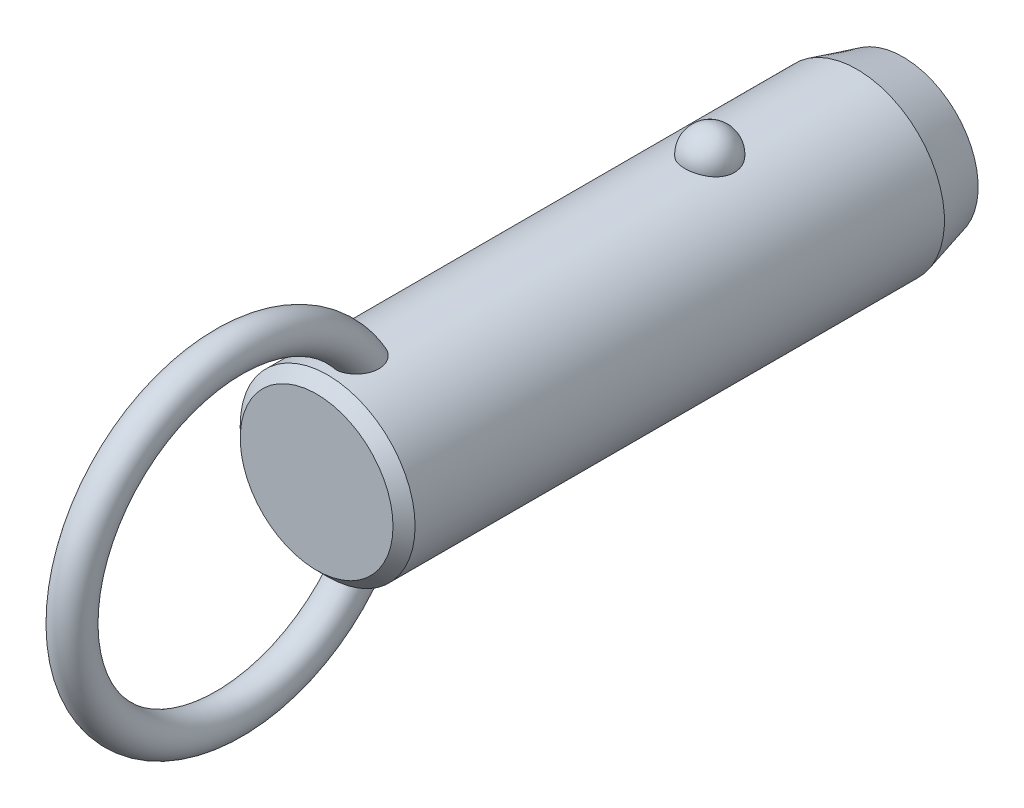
ISO-10303-21;
HEADER;
FILE_DESCRIPTION(('STEP AP214'),'2;1');
FILE_NAME('part.step','',(''),(''),'','','');
FILE_SCHEMA(('AUTOMOTIVE_DESIGN { 1 0 10303 214 1 1 1 1 }'));
ENDSEC;
DATA;
#1=APPLICATION_CONTEXT('core data for automotive mechanical design processes');
#2=APPLICATION_PROTOCOL_DEFINITION('international standard','automotive_design',2000,#1);
#3=PRODUCT_CONTEXT('',#1,'mechanical');
#4=PRODUCT('Part','Part','',(#3));
#5=PRODUCT_RELATED_PRODUCT_CATEGORY('part','',(#4));
#6=PRODUCT_DEFINITION_FORMATION('','',#4);
#7=PRODUCT_DEFINITION_CONTEXT('part definition',#1,'design');
#8=PRODUCT_DEFINITION('design','',#6,#7);
#9=PRODUCT_DEFINITION_SHAPE('','',#8);
#10=(LENGTH_UNIT() NAMED_UNIT(*) SI_UNIT(.MILLI.,.METRE.));
#11=(NAMED_UNIT(*) PLANE_ANGLE_UNIT() SI_UNIT($,.RADIAN.));
#12=(NAMED_UNIT(*) SI_UNIT($,.STERADIAN.) SOLID_ANGLE_UNIT());
#13=UNCERTAINTY_MEASURE_WITH_UNIT(LENGTH_MEASURE(1.E-05),#10,'distance_accuracy_value','');
#14=(GEOMETRIC_REPRESENTATION_CONTEXT(3) GLOBAL_UNCERTAINTY_ASSIGNED_CONTEXT((#13)) GLOBAL_UNIT_ASSIGNED_CONTEXT((#10,
#11,#12)) REPRESENTATION_CONTEXT('',''));
#15=CARTESIAN_POINT('',(0.,0.,0.));
#16=DIRECTION('',(0.,0.,1.));
#17=DIRECTION('',(1.,0.,0.));
#18=AXIS2_PLACEMENT_3D('',#15,#16,#17);
#19=CARTESIAN_POINT('',(0.,0.,30.5));
#20=DIRECTION('',(0.,0.,-1.));
#21=DIRECTION('',(-1.,0.,0.));
#22=AXIS2_PLACEMENT_3D('',#19,#20,#21);
#23=CYLINDRICAL_SURFACE('',#22,9.5);
#24=CARTESIAN_POINT('',(2.67259918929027,9.11631578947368,-2.70000000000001));
#25=CARTESIAN_POINT('',(2.6725968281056,9.11631786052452,-2.54909854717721));
#26=CARTESIAN_POINT('',(2.66030567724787,9.11994722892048,-2.39816735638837));
#27=CARTESIAN_POINT('',(2.6114347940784,9.13405924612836,-2.10058568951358));
#28=CARTESIAN_POINT('',(2.57484658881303,9.14454428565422,-1.95393672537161));
#29=CARTESIAN_POINT('',(2.47830875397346,9.17117631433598,-1.66916069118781));
#30=CARTESIAN_POINT('',(2.41836936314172,9.18732082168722,-1.53102991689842));
#31=CARTESIAN_POINT('',(2.27661331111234,9.22346780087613,-1.26705393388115));
#32=CARTESIAN_POINT('',(2.19479699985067,9.24347021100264,-1.14120852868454));
#33=CARTESIAN_POINT('',(2.01085282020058,9.28522401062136,-0.90463270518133));
#34=CARTESIAN_POINT('',(1.90862396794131,9.30698376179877,-0.793982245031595));
#35=CARTESIAN_POINT('',(1.6867437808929,9.34973971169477,-0.591607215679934));
#36=CARTESIAN_POINT('',(1.56709244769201,9.37073591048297,-0.499882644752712));
#37=CARTESIAN_POINT('',(1.31393976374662,9.40956370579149,-0.338167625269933));
#38=CARTESIAN_POINT('',(1.18048026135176,9.42740444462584,-0.268113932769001));
#39=CARTESIAN_POINT('',(0.903154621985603,9.45799906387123,-0.151390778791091));
#40=CARTESIAN_POINT('',(0.759289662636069,9.47075351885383,-0.104718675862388));
#41=CARTESIAN_POINT('',(0.468074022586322,9.48956256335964,-0.0367633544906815));
#42=CARTESIAN_POINT('',(0.320836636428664,9.49573643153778,-0.0150275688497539));
#43=CARTESIAN_POINT('',(0.0246714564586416,9.50112183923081,0.00396199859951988));
#44=CARTESIAN_POINT('',(-0.124256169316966,9.50033406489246,0.00121819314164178));
#45=CARTESIAN_POINT('',(-0.417264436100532,9.4919475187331,-0.0284441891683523));
#46=CARTESIAN_POINT('',(-0.561384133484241,9.48444885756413,-0.0550074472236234));
#47=CARTESIAN_POINT('',(-0.842986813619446,9.46357853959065,-0.131064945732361));
#48=CARTESIAN_POINT('',(-0.980469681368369,9.450206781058,-0.180559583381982));
#49=CARTESIAN_POINT('',(-1.24585005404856,9.41890822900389,-0.301476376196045));
#50=CARTESIAN_POINT('',(-1.37368611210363,9.40095498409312,-0.37302638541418));
#51=CARTESIAN_POINT('',(-1.61552738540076,9.3624296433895,-0.536025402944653));
#52=CARTESIAN_POINT('',(-1.72953116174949,9.34185727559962,-0.627476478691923));
#53=CARTESIAN_POINT('',(-1.9429225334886,9.29984568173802,-0.82984483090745));
#54=CARTESIAN_POINT('',(-2.04198021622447,9.27839736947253,-0.941108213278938));
#55=CARTESIAN_POINT('',(-2.22026460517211,9.23735994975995,-1.17883414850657));
#56=CARTESIAN_POINT('',(-2.29948985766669,9.21777097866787,-1.30529781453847));
#57=CARTESIAN_POINT('',(-2.43697287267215,9.18238994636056,-1.57158566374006));
#58=CARTESIAN_POINT('',(-2.49497068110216,9.16664569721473,-1.71155057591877));
#59=CARTESIAN_POINT('',(-2.5872073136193,9.14104303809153,-1.99961197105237));
#60=CARTESIAN_POINT('',(-2.62144683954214,9.13118445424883,-2.14770821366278));
#61=CARTESIAN_POINT('',(-2.66521466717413,9.11850622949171,-2.44715424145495));
#62=CARTESIAN_POINT('',(-2.67484831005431,9.11565658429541,-2.59848735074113));
#63=CARTESIAN_POINT('',(-2.66946735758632,9.11723375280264,-2.90067317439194));
#64=CARTESIAN_POINT('',(-2.65445345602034,9.12166036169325,-3.05152590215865));
#65=CARTESIAN_POINT('',(-2.60029711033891,9.13724422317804,-3.34766110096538));
#66=CARTESIAN_POINT('',(-2.56127978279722,9.14836656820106,-3.49296833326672));
#67=CARTESIAN_POINT('',(-2.46018844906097,9.17606676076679,-3.77477535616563));
#68=CARTESIAN_POINT('',(-2.39811349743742,9.1926448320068,-3.9112747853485));
#69=CARTESIAN_POINT('',(-2.25202303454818,9.22952198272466,-4.17244273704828));
#70=CARTESIAN_POINT('',(-2.16788714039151,9.24984129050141,-4.29704106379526));
#71=CARTESIAN_POINT('',(-1.9799408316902,9.29188255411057,-4.53013066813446));
#72=CARTESIAN_POINT('',(-1.87612963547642,9.31360456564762,-4.63862130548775));
#73=CARTESIAN_POINT('',(-1.65105429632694,9.35612959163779,-4.8369029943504));
#74=CARTESIAN_POINT('',(-1.52972405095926,9.37692871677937,-4.92661991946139));
#75=CARTESIAN_POINT('',(-1.27318250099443,9.41518970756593,-5.08429106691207));
#76=CARTESIAN_POINT('',(-1.13797219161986,9.432651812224,-5.15224684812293));
#77=CARTESIAN_POINT('',(-0.859280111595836,9.46208255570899,-5.26371827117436));
#78=CARTESIAN_POINT('',(-0.715925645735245,9.47411833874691,-5.30753421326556));
#79=CARTESIAN_POINT('',(-0.423550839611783,9.4916822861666,-5.37076321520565));
#80=CARTESIAN_POINT('',(-0.274531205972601,9.49721125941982,-5.39017930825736));
#81=CARTESIAN_POINT('',(0.0218446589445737,9.50110860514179,-5.40390587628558));
#82=CARTESIAN_POINT('',(0.169177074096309,9.49961381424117,-5.39869609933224));
#83=CARTESIAN_POINT('',(0.460808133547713,9.48993906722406,-5.36441955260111));
#84=CARTESIAN_POINT('',(0.605106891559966,9.48175936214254,-5.33535367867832));
#85=CARTESIAN_POINT('',(0.886027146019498,9.4596376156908,-5.25435587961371));
#86=CARTESIAN_POINT('',(1.02267710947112,9.44571881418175,-5.20251612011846));
#87=CARTESIAN_POINT('',(1.28523827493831,9.41358993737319,-5.07741549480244));
#88=CARTESIAN_POINT('',(1.41114877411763,9.39537958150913,-5.00415322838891));
#89=CARTESIAN_POINT('',(1.65085227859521,9.3562644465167,-4.83684599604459));
#90=CARTESIAN_POINT('',(1.76442346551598,9.33532178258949,-4.74249218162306));
#91=CARTESIAN_POINT('',(1.97425672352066,9.29321198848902,-4.53620389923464));
#92=CARTESIAN_POINT('',(2.07051582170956,9.27204482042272,-4.42426641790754));
#93=CARTESIAN_POINT('',(2.24490086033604,9.23139221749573,-4.18363183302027));
#94=CARTESIAN_POINT('',(2.32267019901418,9.21194380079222,-4.05466990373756));
#95=CARTESIAN_POINT('',(2.45584092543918,9.1773419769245,-3.78517836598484));
#96=CARTESIAN_POINT('',(2.5112497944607,9.16218713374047,-3.64465264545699));
#97=CARTESIAN_POINT('',(2.59380876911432,9.13913522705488,-3.37104301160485));
#98=CARTESIAN_POINT('',(2.62330266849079,9.13064624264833,-3.23871053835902));
#99=CARTESIAN_POINT('',(2.66269870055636,9.11923566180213,-2.97092664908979));
#100=CARTESIAN_POINT('',(2.67260130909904,9.11631393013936,-2.83547530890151));
#101=CARTESIAN_POINT('',(2.67259918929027,9.11631578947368,-2.70000000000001));
#102=B_SPLINE_CURVE_WITH_KNOTS('',3,(#24,#25,#26,#27,#28,#29,#30,#31,#32,#33,#34,#35,#36,#37,
#38,#39,#40,#41,#42,#43,#44,#45,#46,#47,#48,#49,#50,#51,#52,#53,#54,#55,#56,#57,#58,#59,#60,#61,
#62,#63,#64,#65,#66,#67,#68,#69,#70,#71,#72,#73,#74,#75,#76,#77,#78,#79,#80,#81,#82,#83,#84,#85,
#86,#87,#88,#89,#90,#91,#92,#93,#94,#95,#96,#97,#98,#99,#100,#101),.UNSPECIFIED.,.T.,.F.,(4,2,2,
2,2,2,2,2,2,2,2,2,2,2,2,2,2,2,2,2,2,2,2,2,2,2,2,2,2,2,2,2,2,2,2,2,2,2,4),(0.,0.452217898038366,
0.904593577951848,1.35677112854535,1.80894144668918,2.26340676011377,2.71787203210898,
3.17099820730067,3.62407318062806,4.0687883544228,4.51345969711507,4.95160616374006,
5.38976021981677,5.83050358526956,6.27129275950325,6.72071308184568,7.17016633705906,
7.6249527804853,8.07972578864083,8.53254856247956,8.98535859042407,9.43582813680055,
9.88631615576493,10.3393155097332,10.7923328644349,11.2471065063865,11.7018475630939,
12.150795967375,12.599688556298,13.0398725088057,13.4800399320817,13.9184421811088,
14.3568730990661,14.802202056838,15.2476074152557,15.7010097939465,16.1542603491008,
16.5602594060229,16.966248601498),.UNSPECIFIED.);
#103=CARTESIAN_POINT('',(2.67259918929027,9.11631578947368,-2.70000000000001));
#104=VERTEX_POINT('',#103);
#105=EDGE_CURVE('E41',#104,#104,#102,.T.);
#106=ORIENTED_EDGE('',*,*,#105,.T.);
#107=EDGE_LOOP('',(#106));
#108=FACE_BOUND('',#107,.T.);
#109=CARTESIAN_POINT('',(0.,0.,38.82));
#110=DIRECTION('',(0.,0.,1.));
#111=DIRECTION('',(1.,0.,0.));
#112=AXIS2_PLACEMENT_3D('',#109,#110,#111);
#113=CIRCLE('',#112,9.5);
#114=CARTESIAN_POINT('',(9.5,0.,38.82));
#115=VERTEX_POINT('',#114);
#116=EDGE_CURVE('E10',#115,#115,#113,.F.);
#117=ORIENTED_EDGE('',*,*,#116,.T.);
#118=EDGE_LOOP('',(#117));
#119=FACE_BOUND('',#118,.T.);
#120=CARTESIAN_POINT('',(-0.697062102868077,-9.47439269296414,33.1678088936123));
#121=CARTESIAN_POINT('',(-0.799579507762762,-9.46685146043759,33.2074823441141));
#122=CARTESIAN_POINT('',(-0.898575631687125,-9.45788043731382,33.2559309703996));
#123=CARTESIAN_POINT('',(-1.08670047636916,-9.43811593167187,33.3688685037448));
#124=CARTESIAN_POINT('',(-1.17583204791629,-9.42732297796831,33.4333527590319));
#125=CARTESIAN_POINT('',(-1.34179806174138,-9.40513672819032,33.5762099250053));
#126=CARTESIAN_POINT('',(-1.41865133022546,-9.39374438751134,33.654561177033));
#127=CARTESIAN_POINT('',(-1.5586004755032,-9.37154196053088,33.8227524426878));
#128=CARTESIAN_POINT('',(-1.62169476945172,-9.3607319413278,33.9125937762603));
#129=CARTESIAN_POINT('',(-1.73527695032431,-9.34035749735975,34.1045001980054));
#130=CARTESIAN_POINT('',(-1.7852226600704,-9.33085270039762,34.2068910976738));
#131=CARTESIAN_POINT('',(-1.86924997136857,-9.3143834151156,34.418148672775));
#132=CARTESIAN_POINT('',(-1.90332570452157,-9.30741986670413,34.5270177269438));
#133=CARTESIAN_POINT('',(-1.95893603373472,-9.29588482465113,34.7604730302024));
#134=CARTESIAN_POINT('',(-1.97872420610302,-9.29165182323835,34.8854890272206));
#135=CARTESIAN_POINT('',(-2.00062129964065,-9.28695978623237,35.1370805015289));
#136=CARTESIAN_POINT('',(-2.00272284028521,-9.28650232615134,35.263656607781));
#137=CARTESIAN_POINT('',(-1.98958876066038,-9.28932750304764,35.5368157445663));
#138=CARTESIAN_POINT('',(-1.97143366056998,-9.2932400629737,35.6832519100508));
#139=CARTESIAN_POINT('',(-1.91479925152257,-9.30507151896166,35.9720629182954));
#140=CARTESIAN_POINT('',(-1.87629122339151,-9.31299607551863,36.114431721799));
#141=CARTESIAN_POINT('',(-1.77225683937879,-9.33340232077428,36.4151725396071));
#142=CARTESIAN_POINT('',(-1.70334898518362,-9.34641636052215,36.5723691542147));
#143=CARTESIAN_POINT('',(-1.58111062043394,-9.36759153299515,36.7975171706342));
#144=CARTESIAN_POINT('',(-1.53721459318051,-9.37492619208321,36.8707968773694));
#145=CARTESIAN_POINT('',(-1.44302631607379,-9.38988566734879,37.0130740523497));
#146=CARTESIAN_POINT('',(-1.39273721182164,-9.39751033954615,37.0820736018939));
#147=CARTESIAN_POINT('',(-1.26775962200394,-9.41530678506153,37.2369832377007));
#148=CARTESIAN_POINT('',(-1.19052326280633,-9.42548108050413,37.3208712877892));
#149=CARTESIAN_POINT('',(-1.0242024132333,-9.44499825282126,37.4760086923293));
#150=CARTESIAN_POINT('',(-0.935139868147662,-9.45434261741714,37.5472808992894));
#151=CARTESIAN_POINT('',(-0.766610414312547,-9.46930670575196,37.6586955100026));
#152=CARTESIAN_POINT('',(-0.689439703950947,-9.47529223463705,37.7022354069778));
#153=CARTESIAN_POINT('',(-0.528942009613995,-9.48560294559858,37.7763133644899));
#154=CARTESIAN_POINT('',(-0.445620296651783,-9.48992953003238,37.8068624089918));
#155=CARTESIAN_POINT('',(-0.273901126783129,-9.49644161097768,37.8525792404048));
#156=CARTESIAN_POINT('',(-0.185465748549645,-9.49860811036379,37.86761059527));
#157=CARTESIAN_POINT('',(-0.00734541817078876,-9.5004135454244,37.8801494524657));
#158=CARTESIAN_POINT('',(0.0823387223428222,-9.50005405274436,37.8776678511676));
#159=CARTESIAN_POINT('',(0.24767927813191,-9.49708301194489,37.8569959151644));
#160=CARTESIAN_POINT('',(0.323620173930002,-9.49477609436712,37.8409300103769));
#161=CARTESIAN_POINT('',(0.471981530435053,-9.48855917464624,37.7971726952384));
#162=CARTESIAN_POINT('',(0.544400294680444,-9.48464840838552,37.7694757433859));
#163=CARTESIAN_POINT('',(0.708947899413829,-9.47398336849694,37.6928026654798));
#164=CARTESIAN_POINT('',(0.79914966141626,-9.46671310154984,37.6397745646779));
#165=CARTESIAN_POINT('',(0.969783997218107,-9.4507622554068,37.5199731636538));
#166=CARTESIAN_POINT('',(1.05019415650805,-9.44207854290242,37.4531692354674));
#167=CARTESIAN_POINT('',(1.23092343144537,-9.42051459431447,37.2807596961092));
#168=CARTESIAN_POINT('',(1.32652499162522,-9.40733378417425,37.1702619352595));
#169=CARTESIAN_POINT('',(1.49893121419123,-9.38140745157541,36.9355614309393));
#170=CARTESIAN_POINT('',(1.57571616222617,-9.36866239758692,36.8113445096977));
#171=CARTESIAN_POINT('',(1.71285426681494,-9.34457644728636,36.5493891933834));
#172=CARTESIAN_POINT('',(1.77266365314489,-9.33328726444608,36.4113623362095));
#173=CARTESIAN_POINT('',(1.87239208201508,-9.31379209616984,36.1280515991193));
#174=CARTESIAN_POINT('',(1.91230158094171,-9.3055875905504,35.982764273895));
#175=CARTESIAN_POINT('',(1.9760418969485,-9.29228394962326,35.6620281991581));
#176=CARTESIAN_POINT('',(1.99587438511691,-9.28797202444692,35.4857248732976));
#177=CARTESIAN_POINT('',(2.0029570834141,-9.28645519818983,35.1324146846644));
#178=CARTESIAN_POINT('',(1.99025930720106,-9.28923895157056,34.9554093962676));
#179=CARTESIAN_POINT('',(1.93735479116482,-9.30038134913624,34.6563381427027));
#180=CARTESIAN_POINT('',(1.90576827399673,-9.30697680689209,34.5326679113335));
#181=CARTESIAN_POINT('',(1.82287484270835,-9.32356855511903,34.2923297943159));
#182=CARTESIAN_POINT('',(1.77158213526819,-9.33356239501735,34.1756569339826));
#183=CARTESIAN_POINT('',(1.64885744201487,-9.35602275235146,33.9527061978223));
#184=CARTESIAN_POINT('',(1.57730995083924,-9.36850332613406,33.8464927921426));
#185=CARTESIAN_POINT('',(1.41543264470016,-9.39431873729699,33.6495530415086));
#186=CARTESIAN_POINT('',(1.32510883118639,-9.40765330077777,33.5588217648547));
#187=CARTESIAN_POINT('',(1.13846223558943,-9.43195720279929,33.4050334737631));
#188=CARTESIAN_POINT('',(1.04369890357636,-9.44302894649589,33.3400947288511));
#189=CARTESIAN_POINT('',(0.843965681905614,-9.46296805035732,33.2280388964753));
#190=CARTESIAN_POINT('',(0.739000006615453,-9.4718363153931,33.1809144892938));
#191=CARTESIAN_POINT('',(0.528175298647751,-9.48586140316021,33.1081173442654));
#192=CARTESIAN_POINT('',(0.422686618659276,-9.49119633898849,33.0814024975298));
#193=CARTESIAN_POINT('',(0.208590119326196,-9.49831365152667,33.0460137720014));
#194=CARTESIAN_POINT('',(0.0999817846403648,-9.500095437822,33.0373428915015));
#195=CARTESIAN_POINT('',(-0.12610480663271,-9.49988861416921,33.0383501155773));
#196=CARTESIAN_POINT('',(-0.243578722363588,-9.49757821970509,33.0495942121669));
#197=CARTESIAN_POINT('',(-0.474390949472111,-9.48885165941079,33.093167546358));
#198=CARTESIAN_POINT('',(-0.587729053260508,-9.48243528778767,33.1254978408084));
#199=CARTESIAN_POINT('',(-0.697062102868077,-9.47439269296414,33.1678088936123));
#200=B_SPLINE_CURVE_WITH_KNOTS('',3,(#120,#121,#122,#123,#124,#125,#126,#127,#128,#129,#130,
#131,#132,#133,#134,#135,#136,#137,#138,#139,#140,#141,#142,#143,#144,#145,#146,#147,#148,#149,
#150,#151,#152,#153,#154,#155,#156,#157,#158,#159,#160,#161,#162,#163,#164,#165,#166,#167,#168,
#169,#170,#171,#172,#173,#174,#175,#176,#177,#178,#179,#180,#181,#182,#183,#184,#185,#186,#187,
#188,#189,#190,#191,#192,#193,#194,#195,#196,#197,#198,#199),.UNSPECIFIED.,.T.,.F.,(4,2,2,2,2,2,
2,2,2,2,2,2,2,2,2,2,2,2,2,2,2,2,2,2,2,2,2,2,2,2,2,2,2,2,2,2,2,2,2,4),(0.,0.330119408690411,
0.660143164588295,0.989655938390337,1.31920659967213,1.66074728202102,2.00241415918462,
2.38088696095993,2.75951768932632,3.20065679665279,3.6424200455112,4.15620996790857,
4.41314162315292,4.66994734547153,5.01228664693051,5.35399933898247,5.61943037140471,
5.88463652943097,6.15215502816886,6.41950709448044,6.65144391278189,6.88349136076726,
7.19641200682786,7.51003602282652,7.94779711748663,8.38601491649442,8.83699707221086,
9.28819530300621,9.81778662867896,10.3465317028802,10.7284172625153,11.1100280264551,
11.4938603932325,11.8775702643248,12.2220189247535,12.5663259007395,12.8915939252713,
13.2169159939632,13.5689650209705,13.9210316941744),.UNSPECIFIED.);
#201=CARTESIAN_POINT('',(-0.697062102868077,-9.47439269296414,33.1678088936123));
#202=VERTEX_POINT('',#201);
#203=EDGE_CURVE('E60',#202,#202,#200,.T.);
#204=ORIENTED_EDGE('',*,*,#203,.T.);
#205=EDGE_LOOP('',(#204));
#206=FACE_BOUND('',#205,.T.);
#207=CARTESIAN_POINT('',(-0.697062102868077,9.47439269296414,33.1678088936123));
#208=CARTESIAN_POINT('',(-0.597792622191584,9.48169483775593,33.1293956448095));
#209=CARTESIAN_POINT('',(-0.495106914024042,9.48766580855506,33.0991682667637));
#210=CARTESIAN_POINT('',(-0.285876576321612,9.49627648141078,33.0560327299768));
#211=CARTESIAN_POINT('',(-0.179324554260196,9.49890941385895,33.0431597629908));
#212=CARTESIAN_POINT('',(0.0344157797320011,9.50053798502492,33.0351666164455));
#213=CARTESIAN_POINT('',(0.141603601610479,9.49953613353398,33.0400341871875));
#214=CARTESIAN_POINT('',(0.353563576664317,9.49401038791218,33.0673654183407));
#215=CARTESIAN_POINT('',(0.458336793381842,9.48948807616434,33.08982117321));
#216=CARTESIAN_POINT('',(0.66249373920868,9.4774236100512,33.1516719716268));
#217=CARTESIAN_POINT('',(0.761881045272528,9.46988348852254,33.1910556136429));
#218=CARTESIAN_POINT('',(0.952608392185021,9.45260382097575,33.2856342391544));
#219=CARTESIAN_POINT('',(1.04394806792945,9.44286417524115,33.3408299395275));
#220=CARTESIAN_POINT('',(1.21712767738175,9.4221176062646,33.4660662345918));
#221=CARTESIAN_POINT('',(1.29885671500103,9.41109835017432,33.5362579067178));
#222=CARTESIAN_POINT('',(1.4497897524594,9.38903310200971,33.688980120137));
#223=CARTESIAN_POINT('',(1.51899278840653,9.37798710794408,33.7715116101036));
#224=CARTESIAN_POINT('',(1.64602857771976,9.35654375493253,33.9497763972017));
#225=CARTESIAN_POINT('',(1.70333052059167,9.34618688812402,34.0458916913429));
#226=CARTESIAN_POINT('',(1.80259341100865,9.32755128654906,34.245897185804));
#227=CARTESIAN_POINT('',(1.84454942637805,9.31927322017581,34.3497898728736));
#228=CARTESIAN_POINT('',(1.91637039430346,9.30478365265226,34.5722131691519));
#229=CARTESIAN_POINT('',(1.944805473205,9.29882552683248,34.6912192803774));
#230=CARTESIAN_POINT('',(1.98449865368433,9.29043398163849,34.9321436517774));
#231=CARTESIAN_POINT('',(1.99574908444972,9.28800213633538,35.0540631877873));
#232=CARTESIAN_POINT('',(2.00275141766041,9.28649645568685,35.3169324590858));
#233=CARTESIAN_POINT('',(1.99588238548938,9.28799035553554,35.4579529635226));
#234=CARTESIAN_POINT('',(1.96270559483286,9.29505517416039,35.7376217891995));
#235=CARTESIAN_POINT('',(1.93637872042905,9.30063010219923,35.876267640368));
#236=CARTESIAN_POINT('',(1.85949176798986,9.31633564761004,36.1725616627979));
#237=CARTESIAN_POINT('',(1.80549792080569,9.3270926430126,36.3292907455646));
#238=CARTESIAN_POINT('',(1.67376869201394,9.3516306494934,36.6322840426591));
#239=CARTESIAN_POINT('',(1.59603181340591,9.36541185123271,36.7785475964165));
#240=CARTESIAN_POINT('',(1.4360277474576,9.39110706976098,37.0258138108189));
#241=CARTESIAN_POINT('',(1.35831795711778,9.40278656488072,37.129791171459));
#242=CARTESIAN_POINT('',(1.18774483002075,9.42585025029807,37.3245347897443));
#243=CARTESIAN_POINT('',(1.09490932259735,9.43723493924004,37.4153247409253));
#244=CARTESIAN_POINT('',(0.921110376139,9.45552616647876,37.5562033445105));
#245=CARTESIAN_POINT('',(0.843738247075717,9.46281058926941,37.6106563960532));
#246=CARTESIAN_POINT('',(0.681245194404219,9.47589120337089,37.7067117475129));
#247=CARTESIAN_POINT('',(0.596135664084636,9.48168953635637,37.7483325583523));
#248=CARTESIAN_POINT('',(0.433779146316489,9.49038144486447,37.8100899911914));
#249=CARTESIAN_POINT('',(0.357459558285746,9.49359170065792,37.8326013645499));
#250=CARTESIAN_POINT('',(0.202074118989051,9.49816761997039,37.8645745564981));
#251=CARTESIAN_POINT('',(0.12301025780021,9.49953459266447,37.8740456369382));
#252=CARTESIAN_POINT('',(-0.0357372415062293,9.50026497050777,37.8791143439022));
#253=CARTESIAN_POINT('',(-0.115421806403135,9.49962433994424,37.8746840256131));
#254=CARTESIAN_POINT('',(-0.272823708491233,9.49640854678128,37.8522962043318));
#255=CARTESIAN_POINT('',(-0.35054013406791,9.4938325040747,37.8343325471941));
#256=CARTESIAN_POINT('',(-0.500580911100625,9.4870946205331,37.7868028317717));
#257=CARTESIAN_POINT('',(-0.57297929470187,9.48296359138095,37.7574618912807));
#258=CARTESIAN_POINT('',(-0.712864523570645,9.47347609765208,37.6890087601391));
#259=CARTESIAN_POINT('',(-0.7803490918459,9.46811906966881,37.6498920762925));
#260=CARTESIAN_POINT('',(-0.946309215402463,9.45329720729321,37.539432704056));
#261=CARTESIAN_POINT('',(-1.04090230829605,9.44321512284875,37.4623297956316));
#262=CARTESIAN_POINT('',(-1.21661929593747,9.42219227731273,37.2940971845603));
#263=CARTESIAN_POINT('',(-1.29770519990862,9.41124921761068,37.2029292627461));
#264=CARTESIAN_POINT('',(-1.4731964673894,9.38563439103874,36.9761621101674));
#265=CARTESIAN_POINT('',(-1.56208878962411,9.37102009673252,36.8362895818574));
#266=CARTESIAN_POINT('',(-1.71623987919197,9.34401559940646,36.5439503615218));
#267=CARTESIAN_POINT('',(-1.7814786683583,9.33162728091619,36.3914731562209));
#268=CARTESIAN_POINT('',(-1.88853837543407,9.31055541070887,36.0756470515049));
#269=CARTESIAN_POINT('',(-1.9299899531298,9.30193076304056,35.9121685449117));
#270=CARTESIAN_POINT('',(-1.98590726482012,9.29015757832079,35.5805268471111));
#271=CARTESIAN_POINT('',(-2.00040705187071,9.2870021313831,35.4123698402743));
#272=CARTESIAN_POINT('',(-1.99964701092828,9.28716218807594,35.1050806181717));
#273=CARTESIAN_POINT('',(-1.98908145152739,9.28945704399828,34.9659362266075));
#274=CARTESIAN_POINT('',(-1.94566294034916,9.29865169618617,34.6911539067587));
#275=CARTESIAN_POINT('',(-1.91282062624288,9.30554929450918,34.555514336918));
#276=CARTESIAN_POINT('',(-1.84582133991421,9.31898248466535,34.3578026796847));
#277=CARTESIAN_POINT('',(-1.82038084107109,9.32400364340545,34.2925830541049));
#278=CARTESIAN_POINT('',(-1.76350511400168,9.33492884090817,34.1649033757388));
#279=CARTESIAN_POINT('',(-1.73207305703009,9.3408324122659,34.1024418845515));
#280=CARTESIAN_POINT('',(-1.66324243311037,9.353333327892,33.9809407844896));
#281=CARTESIAN_POINT('',(-1.62584239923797,9.35993084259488,33.9219020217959));
#282=CARTESIAN_POINT('',(-1.545276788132,9.37356864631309,33.8079875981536));
#283=CARTESIAN_POINT('',(-1.50211241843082,9.38060884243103,33.7531110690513));
#284=CARTESIAN_POINT('',(-1.37681147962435,9.40004442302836,33.6099619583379));
#285=CARTESIAN_POINT('',(-1.28916358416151,9.41261047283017,33.5264295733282));
#286=CARTESIAN_POINT('',(-1.09996826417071,9.43658180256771,33.3772360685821));
#287=CARTESIAN_POINT('',(-0.998461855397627,9.44799034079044,33.3115238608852));
#288=CARTESIAN_POINT('',(-0.860188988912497,9.46103017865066,33.2394367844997));
#289=CARTESIAN_POINT('',(-0.828141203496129,9.46389141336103,33.2238511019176));
#290=CARTESIAN_POINT('',(-0.763210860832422,9.46934915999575,33.1944734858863));
#291=CARTESIAN_POINT('',(-0.730328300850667,9.47194567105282,33.1806815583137));
#292=CARTESIAN_POINT('',(-0.697062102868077,9.47439269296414,33.1678088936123));
#293=B_SPLINE_CURVE_WITH_KNOTS('',3,(#207,#208,#209,#210,#211,#212,#213,#214,#215,#216,#217,
#218,#219,#220,#221,#222,#223,#224,#225,#226,#227,#228,#229,#230,#231,#232,#233,#234,#235,#236,
#237,#238,#239,#240,#241,#242,#243,#244,#245,#246,#247,#248,#249,#250,#251,#252,#253,#254,#255,
#256,#257,#258,#259,#260,#261,#262,#263,#264,#265,#266,#267,#268,#269,#270,#271,#272,#273,#274,
#275,#276,#277,#278,#279,#280,#281,#282,#283,#284,#285,#286,#287,#288,#289,#290,#291,#292),
.UNSPECIFIED.,.T.,.F.,(4,2,2,2,2,2,2,2,2,2,2,2,2,2,2,2,2,2,2,2,2,2,2,2,2,2,2,2,2,2,2,2,2,2,2,2,
2,2,2,2,2,2,4),(0.,0.319942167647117,0.640532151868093,0.96090081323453,1.28112555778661,
1.60113495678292,1.92115886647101,2.24457323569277,2.56801248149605,2.90371927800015,
3.23953387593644,3.60560313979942,3.97183576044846,4.39383693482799,4.81625324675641,
5.31257045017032,5.80891895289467,6.19868344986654,6.58773876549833,6.87145417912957,
7.15475838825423,7.3926375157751,7.63034760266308,7.86853584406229,8.10683246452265,
8.3406366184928,8.57454843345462,8.93983939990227,9.30614105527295,9.80266668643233,
10.2996107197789,10.8040753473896,11.3079021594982,11.7249776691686,12.1418541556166,
12.3521485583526,12.562331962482,12.7725671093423,12.9827582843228,13.3458276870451,
13.7078449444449,13.8150604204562,13.9222762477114),.UNSPECIFIED.);
#294=CARTESIAN_POINT('',(-0.697062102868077,9.47439269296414,33.1678088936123));
#295=VERTEX_POINT('',#294);
#296=EDGE_CURVE('E68',#295,#295,#293,.T.);
#297=ORIENTED_EDGE('',*,*,#296,.T.);
#298=EDGE_LOOP('',(#297));
#299=FACE_BOUND('',#298,.T.);
#300=CARTESIAN_POINT('',(0.,0.,-18.7));
#301=DIRECTION('',(0.,0.,-1.));
#302=DIRECTION('',(-1.,0.,0.));
#303=AXIS2_PLACEMENT_3D('',#300,#301,#302);
#304=CIRCLE('',#303,9.5);
#305=CARTESIAN_POINT('',(-9.5,0.,-18.7));
#306=VERTEX_POINT('',#305);
#307=EDGE_CURVE('E57',#306,#306,#304,.F.);
#308=ORIENTED_EDGE('',*,*,#307,.T.);
#309=EDGE_LOOP('',(#308));
#310=FACE_BOUND('',#309,.T.);
#311=ADVANCED_FACE('F37',(#108,#119,#206,#299,#310),#23,.T.);
#312=CARTESIAN_POINT('',(0.,0.,-23.7));
#313=DIRECTION('',(0.,0.,-1.));
#314=DIRECTION('',(-1.,0.,0.));
#315=AXIS2_PLACEMENT_3D('',#312,#313,#314);
#316=PLANE('',#315);
#317=CARTESIAN_POINT('',(0.,0.,-23.7));
#318=DIRECTION('',(0.,0.,-1.));
#319=DIRECTION('',(-1.,0.,0.));
#320=AXIS2_PLACEMENT_3D('',#317,#318,#319);
#321=CIRCLE('',#320,8.16025403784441);
#322=CARTESIAN_POINT('',(-8.16025403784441,0.,-23.7));
#323=VERTEX_POINT('',#322);
#324=EDGE_CURVE('E67',#323,#323,#321,.T.);
#325=ORIENTED_EDGE('',*,*,#324,.T.);
#326=EDGE_LOOP('',(#325));
#327=FACE_BOUND('',#326,.T.);
#328=ADVANCED_FACE('F86',(#327),#316,.T.);
#329=CARTESIAN_POINT('',(0.,0.,-23.7));
#330=DIRECTION('',(0.,0.,1.));
#331=DIRECTION('',(1.,0.,0.));
#332=AXIS2_PLACEMENT_3D('',#329,#330,#331);
#333=CONICAL_SURFACE('',#332,8.16025403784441,0.261799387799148);
#334=ORIENTED_EDGE('',*,*,#307,.F.);
#335=EDGE_LOOP('',(#334));
#336=FACE_BOUND('',#335,.T.);
#337=ORIENTED_EDGE('',*,*,#324,.F.);
#338=EDGE_LOOP('',(#337));
#339=FACE_BOUND('',#338,.T.);
#340=ADVANCED_FACE('F84',(#336,#339),#333,.T.);
#341=CARTESIAN_POINT('',(0.,0.,40.02));
#342=DIRECTION('',(0.,0.,1.));
#343=DIRECTION('',(1.,0.,0.));
#344=AXIS2_PLACEMENT_3D('',#341,#342,#343);
#345=PLANE('',#344);
#346=CARTESIAN_POINT('',(0.,0.,40.02));
#347=DIRECTION('',(0.,0.,1.));
#348=DIRECTION('',(1.,0.,0.));
#349=AXIS2_PLACEMENT_3D('',#346,#347,#348);
#350=CIRCLE('',#349,8.30000000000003);
#351=CARTESIAN_POINT('',(8.30000000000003,0.,40.02));
#352=VERTEX_POINT('',#351);
#353=EDGE_CURVE('E50',#352,#352,#350,.T.);
#354=ORIENTED_EDGE('',*,*,#353,.T.);
#355=EDGE_LOOP('',(#354));
#356=FACE_BOUND('',#355,.T.);
#357=ADVANCED_FACE('F78',(#356),#345,.T.);
#358=CARTESIAN_POINT('',(0.,0.,49.55));
#359=DIRECTION('',(1.,0.,0.));
#360=DIRECTION('',(0.,0.,-1.));
#361=AXIS2_PLACEMENT_3D('',#358,#359,#360);
#362=TOROIDAL_SURFACE('',#361,17.05,2.);
#363=ORIENTED_EDGE('',*,*,#296,.F.);
#364=EDGE_LOOP('',(#363));
#365=FACE_BOUND('',#364,.T.);
#366=ORIENTED_EDGE('',*,*,#203,.F.);
#367=EDGE_LOOP('',(#366));
#368=FACE_BOUND('',#367,.T.);
#369=ADVANCED_FACE('F74',(#365,#368),#362,.T.);
#370=CARTESIAN_POINT('',(0.,0.,40.02));
#371=DIRECTION('',(0.,0.,-1.));
#372=DIRECTION('',(-1.,0.,0.));
#373=AXIS2_PLACEMENT_3D('',#370,#371,#372);
#374=CONICAL_SURFACE('',#373,8.30000000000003,0.785398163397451);
#375=ORIENTED_EDGE('',*,*,#116,.F.);
#376=EDGE_LOOP('',(#375));
#377=FACE_BOUND('',#376,.T.);
#378=ORIENTED_EDGE('',*,*,#353,.F.);
#379=EDGE_LOOP('',(#378));
#380=FACE_BOUND('',#379,.T.);
#381=ADVANCED_FACE('F39',(#377,#380),#374,.T.);
#382=CARTESIAN_POINT('',(0.,9.5,-2.7));
#383=DIRECTION('',(0.,1.,0.));
#384=DIRECTION('',(0.,0.,-1.));
#385=AXIS2_PLACEMENT_3D('',#382,#383,#384);
#386=SPHERICAL_SURFACE('',#385,2.7);
#387=ORIENTED_EDGE('',*,*,#105,.F.);
#388=EDGE_LOOP('',(#387));
#389=FACE_BOUND('',#388,.T.);
#390=ADVANCED_FACE('F80',(#389),#386,.T.);
#391=CLOSED_SHELL('',(#311,#328,#340,#357,#369,#381,#390));
#392=MANIFOLD_SOLID_BREP('B2',#391);
#393=ADVANCED_BREP_SHAPE_REPRESENTATION('',(#18,#392),#14);
#394=SHAPE_DEFINITION_REPRESENTATION(#9,#393);
ENDSEC;
END-ISO-10303-21;
